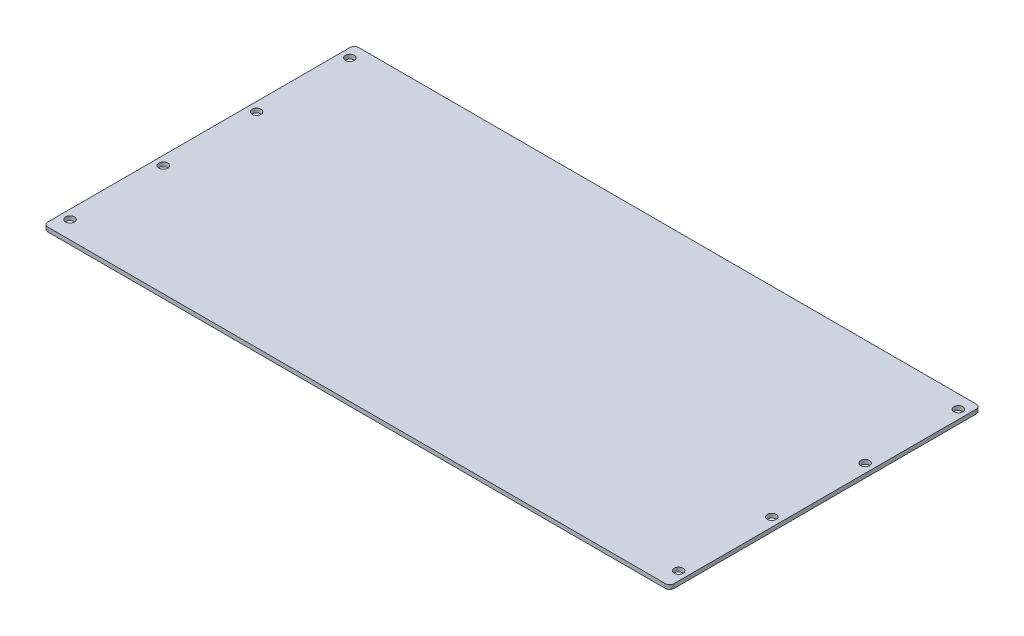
ISO-10303-21;
HEADER;
FILE_DESCRIPTION(('STEP AP214'),'2;1');
FILE_NAME('part.step','',(''),(''),'','','');
FILE_SCHEMA(('AUTOMOTIVE_DESIGN { 1 0 10303 214 1 1 1 1 }'));
ENDSEC;
DATA;
#1=APPLICATION_CONTEXT('core data for automotive mechanical design processes');
#2=APPLICATION_PROTOCOL_DEFINITION('international standard','automotive_design',2000,#1);
#3=PRODUCT_CONTEXT('',#1,'mechanical');
#4=PRODUCT('Part','Part','',(#3));
#5=PRODUCT_RELATED_PRODUCT_CATEGORY('part','',(#4));
#6=PRODUCT_DEFINITION_FORMATION('','',#4);
#7=PRODUCT_DEFINITION_CONTEXT('part definition',#1,'design');
#8=PRODUCT_DEFINITION('design','',#6,#7);
#9=PRODUCT_DEFINITION_SHAPE('','',#8);
#10=(LENGTH_UNIT() NAMED_UNIT(*) SI_UNIT(.MILLI.,.METRE.));
#11=(NAMED_UNIT(*) PLANE_ANGLE_UNIT() SI_UNIT($,.RADIAN.));
#12=(NAMED_UNIT(*) SI_UNIT($,.STERADIAN.) SOLID_ANGLE_UNIT());
#13=UNCERTAINTY_MEASURE_WITH_UNIT(LENGTH_MEASURE(1.E-05),#10,'distance_accuracy_value','');
#14=(GEOMETRIC_REPRESENTATION_CONTEXT(3) GLOBAL_UNCERTAINTY_ASSIGNED_CONTEXT((#13)) GLOBAL_UNIT_ASSIGNED_CONTEXT((#10,
#11,#12)) REPRESENTATION_CONTEXT('',''));
#15=CARTESIAN_POINT('',(0.,0.,0.));
#16=DIRECTION('',(0.,0.,1.));
#17=DIRECTION('',(1.,0.,0.));
#18=AXIS2_PLACEMENT_3D('',#15,#16,#17);
#19=CARTESIAN_POINT('',(220.6625,313.188238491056,272.550730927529));
#20=DIRECTION('',(0.,-1.,0.));
#21=DIRECTION('',(0.,0.,-1.));
#22=AXIS2_PLACEMENT_3D('',#19,#20,#21);
#23=CYLINDRICAL_SURFACE('',#22,3.175);
#24=CARTESIAN_POINT('',(220.6625,313.188238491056,272.550730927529));
#25=DIRECTION('',(0.,1.,0.));
#26=DIRECTION('',(0.,0.,1.));
#27=AXIS2_PLACEMENT_3D('',#24,#25,#26);
#28=CIRCLE('',#27,3.175);
#29=CARTESIAN_POINT('',(223.8375,313.188238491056,272.550730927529));
#30=VERTEX_POINT('',#29);
#31=CARTESIAN_POINT('',(220.6625,313.188238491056,269.375730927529));
#32=VERTEX_POINT('',#31);
#33=EDGE_CURVE('E178',#30,#32,#28,.T.);
#34=ORIENTED_EDGE('',*,*,#33,.F.);
#35=DIRECTION('',(0.,1.,0.));
#36=VECTOR('',#35,1.);
#37=CARTESIAN_POINT('',(223.8375,313.188238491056,272.550730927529));
#38=LINE('',#37,#36);
#39=CARTESIAN_POINT('',(223.8375,310.191038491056,272.550730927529));
#40=VERTEX_POINT('',#39);
#41=EDGE_CURVE('E213',#40,#30,#38,.T.);
#42=ORIENTED_EDGE('',*,*,#41,.F.);
#43=CARTESIAN_POINT('',(220.6625,310.191038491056,272.550730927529));
#44=DIRECTION('',(0.,-1.,0.));
#45=DIRECTION('',(0.,0.,1.));
#46=AXIS2_PLACEMENT_3D('',#43,#44,#45);
#47=CIRCLE('',#46,3.175);
#48=CARTESIAN_POINT('',(220.6625,310.191038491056,269.375730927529));
#49=VERTEX_POINT('',#48);
#50=EDGE_CURVE('E11',#49,#40,#47,.T.);
#51=ORIENTED_EDGE('',*,*,#50,.F.);
#52=DIRECTION('',(0.,-1.,0.));
#53=VECTOR('',#52,1.);
#54=CARTESIAN_POINT('',(220.6625,313.188238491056,269.375730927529));
#55=LINE('',#54,#53);
#56=EDGE_CURVE('E204',#32,#49,#55,.T.);
#57=ORIENTED_EDGE('',*,*,#56,.F.);
#58=EDGE_LOOP('',(#34,#42,#51,#57));
#59=FACE_BOUND('',#58,.T.);
#60=ADVANCED_FACE('F17',(#59),#23,.T.);
#61=CARTESIAN_POINT('',(-220.6625,313.188238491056,272.550730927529));
#62=DIRECTION('',(0.,1.,0.));
#63=DIRECTION('',(0.,0.,1.));
#64=AXIS2_PLACEMENT_3D('',#61,#62,#63);
#65=CYLINDRICAL_SURFACE('',#64,3.175);
#66=CARTESIAN_POINT('',(-220.6625,313.188238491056,272.550730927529));
#67=DIRECTION('',(0.,1.,0.));
#68=DIRECTION('',(0.,0.,1.));
#69=AXIS2_PLACEMENT_3D('',#66,#67,#68);
#70=CIRCLE('',#69,3.175);
#71=CARTESIAN_POINT('',(-220.6625,313.188238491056,269.375730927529));
#72=VERTEX_POINT('',#71);
#73=CARTESIAN_POINT('',(-223.8375,313.188238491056,272.550730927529));
#74=VERTEX_POINT('',#73);
#75=EDGE_CURVE('E282',#72,#74,#70,.T.);
#76=ORIENTED_EDGE('',*,*,#75,.F.);
#77=DIRECTION('',(0.,1.,0.));
#78=VECTOR('',#77,1.);
#79=CARTESIAN_POINT('',(-220.6625,313.188238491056,269.375730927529));
#80=LINE('',#79,#78);
#81=CARTESIAN_POINT('',(-220.6625,310.191038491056,269.375730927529));
#82=VERTEX_POINT('',#81);
#83=EDGE_CURVE('E234',#82,#72,#80,.T.);
#84=ORIENTED_EDGE('',*,*,#83,.F.);
#85=CARTESIAN_POINT('',(-220.6625,310.191038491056,272.550730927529));
#86=DIRECTION('',(0.,-1.,0.));
#87=DIRECTION('',(0.,0.,1.));
#88=AXIS2_PLACEMENT_3D('',#85,#86,#87);
#89=CIRCLE('',#88,3.175);
#90=CARTESIAN_POINT('',(-223.8375,310.191038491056,272.550730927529));
#91=VERTEX_POINT('',#90);
#92=EDGE_CURVE('E26',#91,#82,#89,.T.);
#93=ORIENTED_EDGE('',*,*,#92,.F.);
#94=DIRECTION('',(0.,-1.,0.));
#95=VECTOR('',#94,1.);
#96=CARTESIAN_POINT('',(-223.8375,310.191038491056,272.550730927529));
#97=LINE('',#96,#95);
#98=EDGE_CURVE('E221',#74,#91,#97,.T.);
#99=ORIENTED_EDGE('',*,*,#98,.F.);
#100=EDGE_LOOP('',(#76,#84,#93,#99));
#101=FACE_BOUND('',#100,.T.);
#102=ADVANCED_FACE('F321',(#101),#65,.T.);
#103=CARTESIAN_POINT('',(-220.6625,313.188238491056,488.450730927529));
#104=DIRECTION('',(0.,-1.,0.));
#105=DIRECTION('',(0.,0.,-1.));
#106=AXIS2_PLACEMENT_3D('',#103,#104,#105);
#107=CYLINDRICAL_SURFACE('',#106,3.175);
#108=CARTESIAN_POINT('',(-220.6625,313.188238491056,488.450730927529));
#109=DIRECTION('',(0.,1.,0.));
#110=DIRECTION('',(0.,0.,1.));
#111=AXIS2_PLACEMENT_3D('',#108,#109,#110);
#112=CIRCLE('',#111,3.175);
#113=CARTESIAN_POINT('',(-223.8375,313.188238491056,488.450730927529));
#114=VERTEX_POINT('',#113);
#115=CARTESIAN_POINT('',(-220.6625,313.188238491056,491.625730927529));
#116=VERTEX_POINT('',#115);
#117=EDGE_CURVE('E186',#114,#116,#112,.T.);
#118=ORIENTED_EDGE('',*,*,#117,.F.);
#119=DIRECTION('',(0.,1.,0.));
#120=VECTOR('',#119,1.);
#121=CARTESIAN_POINT('',(-223.8375,313.188238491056,488.450730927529));
#122=LINE('',#121,#120);
#123=CARTESIAN_POINT('',(-223.8375,310.191038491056,488.450730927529));
#124=VERTEX_POINT('',#123);
#125=EDGE_CURVE('E222',#124,#114,#122,.T.);
#126=ORIENTED_EDGE('',*,*,#125,.F.);
#127=CARTESIAN_POINT('',(-220.6625,310.191038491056,488.450730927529));
#128=DIRECTION('',(0.,-1.,0.));
#129=DIRECTION('',(0.,0.,1.));
#130=AXIS2_PLACEMENT_3D('',#127,#128,#129);
#131=CIRCLE('',#130,3.175);
#132=CARTESIAN_POINT('',(-220.6625,310.191038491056,491.625730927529));
#133=VERTEX_POINT('',#132);
#134=EDGE_CURVE('E20',#133,#124,#131,.T.);
#135=ORIENTED_EDGE('',*,*,#134,.F.);
#136=DIRECTION('',(0.,-1.,0.));
#137=VECTOR('',#136,1.);
#138=CARTESIAN_POINT('',(-220.6625,313.188238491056,491.625730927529));
#139=LINE('',#138,#137);
#140=EDGE_CURVE('E191',#116,#133,#139,.T.);
#141=ORIENTED_EDGE('',*,*,#140,.F.);
#142=EDGE_LOOP('',(#118,#126,#135,#141));
#143=FACE_BOUND('',#142,.T.);
#144=ADVANCED_FACE('F315',(#143),#107,.T.);
#145=CARTESIAN_POINT('',(220.6625,313.188238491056,488.450730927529));
#146=DIRECTION('',(0.,1.,0.));
#147=DIRECTION('',(0.,0.,1.));
#148=AXIS2_PLACEMENT_3D('',#145,#146,#147);
#149=CYLINDRICAL_SURFACE('',#148,3.175);
#150=CARTESIAN_POINT('',(220.6625,313.188238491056,488.450730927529));
#151=DIRECTION('',(0.,1.,0.));
#152=DIRECTION('',(0.,0.,1.));
#153=AXIS2_PLACEMENT_3D('',#150,#151,#152);
#154=CIRCLE('',#153,3.175);
#155=CARTESIAN_POINT('',(220.6625,313.188238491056,491.625730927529));
#156=VERTEX_POINT('',#155);
#157=CARTESIAN_POINT('',(223.8375,313.188238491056,488.450730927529));
#158=VERTEX_POINT('',#157);
#159=EDGE_CURVE('E166',#156,#158,#154,.T.);
#160=ORIENTED_EDGE('',*,*,#159,.F.);
#161=DIRECTION('',(0.,1.,0.));
#162=VECTOR('',#161,1.);
#163=CARTESIAN_POINT('',(220.6625,313.188238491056,491.625730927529));
#164=LINE('',#163,#162);
#165=CARTESIAN_POINT('',(220.6625,310.191038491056,491.625730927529));
#166=VERTEX_POINT('',#165);
#167=EDGE_CURVE('E170',#166,#156,#164,.T.);
#168=ORIENTED_EDGE('',*,*,#167,.F.);
#169=CARTESIAN_POINT('',(220.6625,310.191038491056,488.450730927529));
#170=DIRECTION('',(0.,-1.,0.));
#171=DIRECTION('',(0.,0.,1.));
#172=AXIS2_PLACEMENT_3D('',#169,#170,#171);
#173=CIRCLE('',#172,3.175);
#174=CARTESIAN_POINT('',(223.8375,310.191038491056,488.450730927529));
#175=VERTEX_POINT('',#174);
#176=EDGE_CURVE('E277',#175,#166,#173,.T.);
#177=ORIENTED_EDGE('',*,*,#176,.F.);
#178=DIRECTION('',(0.,-1.,0.));
#179=VECTOR('',#178,1.);
#180=CARTESIAN_POINT('',(223.8375,310.191038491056,488.450730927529));
#181=LINE('',#180,#179);
#182=EDGE_CURVE('E173',#158,#175,#181,.T.);
#183=ORIENTED_EDGE('',*,*,#182,.F.);
#184=EDGE_LOOP('',(#160,#168,#177,#183));
#185=FACE_BOUND('',#184,.T.);
#186=ADVANCED_FACE('F168',(#185),#149,.T.);
#187=CARTESIAN_POINT('',(217.4875,313.188238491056,412.250730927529));
#188=DIRECTION('',(0.,-1.,0.));
#189=DIRECTION('',(0.,0.,-1.));
#190=AXIS2_PLACEMENT_3D('',#187,#188,#189);
#191=CYLINDRICAL_SURFACE('',#190,3.175);
#192=CARTESIAN_POINT('',(217.4875,310.191038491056,412.250730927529));
#193=DIRECTION('',(0.,-1.,0.));
#194=DIRECTION('',(0.,0.,1.));
#195=AXIS2_PLACEMENT_3D('',#192,#193,#194);
#196=CIRCLE('',#195,3.175);
#197=CARTESIAN_POINT('',(217.4875,310.191038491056,415.425730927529));
#198=VERTEX_POINT('',#197);
#199=EDGE_CURVE('E291',#198,#198,#196,.T.);
#200=ORIENTED_EDGE('',*,*,#199,.T.);
#201=EDGE_LOOP('',(#200));
#202=FACE_BOUND('',#201,.T.);
#203=CARTESIAN_POINT('',(217.4875,313.188238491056,412.250730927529));
#204=DIRECTION('',(0.,-1.,0.));
#205=DIRECTION('',(0.,0.,-1.));
#206=AXIS2_PLACEMENT_3D('',#203,#204,#205);
#207=CIRCLE('',#206,3.175);
#208=CARTESIAN_POINT('',(217.4875,313.188238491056,409.075730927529));
#209=VERTEX_POINT('',#208);
#210=EDGE_CURVE('E249',#209,#209,#207,.T.);
#211=ORIENTED_EDGE('',*,*,#210,.F.);
#212=EDGE_LOOP('',(#211));
#213=FACE_BOUND('',#212,.T.);
#214=ADVANCED_FACE('F357',(#202,#213),#191,.F.);
#215=CARTESIAN_POINT('',(217.4875,313.188238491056,345.575730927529));
#216=DIRECTION('',(0.,-1.,0.));
#217=DIRECTION('',(0.,0.,-1.));
#218=AXIS2_PLACEMENT_3D('',#215,#216,#217);
#219=CYLINDRICAL_SURFACE('',#218,3.175);
#220=CARTESIAN_POINT('',(217.4875,310.191038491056,345.575730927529));
#221=DIRECTION('',(0.,-1.,0.));
#222=DIRECTION('',(0.,0.,1.));
#223=AXIS2_PLACEMENT_3D('',#220,#221,#222);
#224=CIRCLE('',#223,3.175);
#225=CARTESIAN_POINT('',(217.4875,310.191038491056,348.750730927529));
#226=VERTEX_POINT('',#225);
#227=EDGE_CURVE('E286',#226,#226,#224,.T.);
#228=ORIENTED_EDGE('',*,*,#227,.T.);
#229=EDGE_LOOP('',(#228));
#230=FACE_BOUND('',#229,.T.);
#231=CARTESIAN_POINT('',(217.4875,313.188238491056,345.575730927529));
#232=DIRECTION('',(0.,-1.,0.));
#233=DIRECTION('',(0.,0.,-1.));
#234=AXIS2_PLACEMENT_3D('',#231,#232,#233);
#235=CIRCLE('',#234,3.175);
#236=CARTESIAN_POINT('',(217.4875,313.188238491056,342.400730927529));
#237=VERTEX_POINT('',#236);
#238=EDGE_CURVE('E252',#237,#237,#235,.T.);
#239=ORIENTED_EDGE('',*,*,#238,.F.);
#240=EDGE_LOOP('',(#239));
#241=FACE_BOUND('',#240,.T.);
#242=ADVANCED_FACE('F353',(#230,#241),#219,.F.);
#243=CARTESIAN_POINT('',(217.4875,313.188238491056,278.900730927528));
#244=DIRECTION('',(0.,-1.,0.));
#245=DIRECTION('',(0.,0.,-1.));
#246=AXIS2_PLACEMENT_3D('',#243,#244,#245);
#247=CYLINDRICAL_SURFACE('',#246,3.175);
#248=CARTESIAN_POINT('',(217.4875,310.191038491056,278.900730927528));
#249=DIRECTION('',(0.,-1.,0.));
#250=DIRECTION('',(0.,0.,1.));
#251=AXIS2_PLACEMENT_3D('',#248,#249,#250);
#252=CIRCLE('',#251,3.175);
#253=CARTESIAN_POINT('',(217.4875,310.191038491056,282.075730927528));
#254=VERTEX_POINT('',#253);
#255=EDGE_CURVE('E283',#254,#254,#252,.T.);
#256=ORIENTED_EDGE('',*,*,#255,.T.);
#257=EDGE_LOOP('',(#256));
#258=FACE_BOUND('',#257,.T.);
#259=CARTESIAN_POINT('',(217.4875,313.188238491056,278.900730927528));
#260=DIRECTION('',(0.,-1.,0.));
#261=DIRECTION('',(0.,0.,-1.));
#262=AXIS2_PLACEMENT_3D('',#259,#260,#261);
#263=CIRCLE('',#262,3.175);
#264=CARTESIAN_POINT('',(217.4875,313.188238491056,275.725730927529));
#265=VERTEX_POINT('',#264);
#266=EDGE_CURVE('E255',#265,#265,#263,.T.);
#267=ORIENTED_EDGE('',*,*,#266,.F.);
#268=EDGE_LOOP('',(#267));
#269=FACE_BOUND('',#268,.T.);
#270=ADVANCED_FACE('F356',(#258,#269),#247,.F.);
#271=CARTESIAN_POINT('',(-217.4875,313.188238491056,278.900730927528));
#272=DIRECTION('',(0.,-1.,0.));
#273=DIRECTION('',(0.,0.,-1.));
#274=AXIS2_PLACEMENT_3D('',#271,#272,#273);
#275=CYLINDRICAL_SURFACE('',#274,3.175);
#276=CARTESIAN_POINT('',(-217.4875,310.191038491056,278.900730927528));
#277=DIRECTION('',(0.,-1.,0.));
#278=DIRECTION('',(0.,0.,1.));
#279=AXIS2_PLACEMENT_3D('',#276,#277,#278);
#280=CIRCLE('',#279,3.175);
#281=CARTESIAN_POINT('',(-217.4875,310.191038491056,282.075730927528));
#282=VERTEX_POINT('',#281);
#283=EDGE_CURVE('E272',#282,#282,#280,.T.);
#284=ORIENTED_EDGE('',*,*,#283,.T.);
#285=EDGE_LOOP('',(#284));
#286=FACE_BOUND('',#285,.T.);
#287=CARTESIAN_POINT('',(-217.4875,313.188238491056,278.900730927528));
#288=DIRECTION('',(0.,-1.,0.));
#289=DIRECTION('',(0.,0.,-1.));
#290=AXIS2_PLACEMENT_3D('',#287,#288,#289);
#291=CIRCLE('',#290,3.175);
#292=CARTESIAN_POINT('',(-217.4875,313.188238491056,275.725730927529));
#293=VERTEX_POINT('',#292);
#294=EDGE_CURVE('E258',#293,#293,#291,.T.);
#295=ORIENTED_EDGE('',*,*,#294,.F.);
#296=EDGE_LOOP('',(#295));
#297=FACE_BOUND('',#296,.T.);
#298=ADVANCED_FACE('F359',(#286,#297),#275,.F.);
#299=CARTESIAN_POINT('',(-217.4875,313.188238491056,345.575730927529));
#300=DIRECTION('',(0.,-1.,0.));
#301=DIRECTION('',(0.,0.,-1.));
#302=AXIS2_PLACEMENT_3D('',#299,#300,#301);
#303=CYLINDRICAL_SURFACE('',#302,3.175);
#304=CARTESIAN_POINT('',(-217.4875,310.191038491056,345.575730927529));
#305=DIRECTION('',(0.,-1.,0.));
#306=DIRECTION('',(0.,0.,1.));
#307=AXIS2_PLACEMENT_3D('',#304,#305,#306);
#308=CIRCLE('',#307,3.175);
#309=CARTESIAN_POINT('',(-217.4875,310.191038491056,348.750730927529));
#310=VERTEX_POINT('',#309);
#311=EDGE_CURVE('E268',#310,#310,#308,.T.);
#312=ORIENTED_EDGE('',*,*,#311,.T.);
#313=EDGE_LOOP('',(#312));
#314=FACE_BOUND('',#313,.T.);
#315=CARTESIAN_POINT('',(-217.4875,313.188238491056,345.575730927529));
#316=DIRECTION('',(0.,-1.,0.));
#317=DIRECTION('',(0.,0.,-1.));
#318=AXIS2_PLACEMENT_3D('',#315,#316,#317);
#319=CIRCLE('',#318,3.175);
#320=CARTESIAN_POINT('',(-217.4875,313.188238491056,342.400730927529));
#321=VERTEX_POINT('',#320);
#322=EDGE_CURVE('E259',#321,#321,#319,.T.);
#323=ORIENTED_EDGE('',*,*,#322,.F.);
#324=EDGE_LOOP('',(#323));
#325=FACE_BOUND('',#324,.T.);
#326=ADVANCED_FACE('F362',(#314,#325),#303,.F.);
#327=CARTESIAN_POINT('',(-217.4875,313.188238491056,412.250730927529));
#328=DIRECTION('',(0.,-1.,0.));
#329=DIRECTION('',(0.,0.,-1.));
#330=AXIS2_PLACEMENT_3D('',#327,#328,#329);
#331=CYLINDRICAL_SURFACE('',#330,3.175);
#332=CARTESIAN_POINT('',(-217.4875,310.191038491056,412.250730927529));
#333=DIRECTION('',(0.,-1.,0.));
#334=DIRECTION('',(0.,0.,1.));
#335=AXIS2_PLACEMENT_3D('',#332,#333,#334);
#336=CIRCLE('',#335,3.175);
#337=CARTESIAN_POINT('',(-217.4875,310.191038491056,415.425730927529));
#338=VERTEX_POINT('',#337);
#339=EDGE_CURVE('E271',#338,#338,#336,.T.);
#340=ORIENTED_EDGE('',*,*,#339,.T.);
#341=EDGE_LOOP('',(#340));
#342=FACE_BOUND('',#341,.T.);
#343=CARTESIAN_POINT('',(-217.4875,313.188238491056,412.250730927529));
#344=DIRECTION('',(0.,-1.,0.));
#345=DIRECTION('',(0.,0.,-1.));
#346=AXIS2_PLACEMENT_3D('',#343,#344,#345);
#347=CIRCLE('',#346,3.175);
#348=CARTESIAN_POINT('',(-217.4875,313.188238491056,409.075730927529));
#349=VERTEX_POINT('',#348);
#350=EDGE_CURVE('E262',#349,#349,#347,.T.);
#351=ORIENTED_EDGE('',*,*,#350,.F.);
#352=EDGE_LOOP('',(#351));
#353=FACE_BOUND('',#352,.T.);
#354=ADVANCED_FACE('F369',(#342,#353),#331,.F.);
#355=CARTESIAN_POINT('',(-217.4875,313.188238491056,478.925730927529));
#356=DIRECTION('',(0.,-1.,0.));
#357=DIRECTION('',(0.,0.,-1.));
#358=AXIS2_PLACEMENT_3D('',#355,#356,#357);
#359=CYLINDRICAL_SURFACE('',#358,3.175);
#360=CARTESIAN_POINT('',(-217.4875,310.191038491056,478.925730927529));
#361=DIRECTION('',(0.,-1.,0.));
#362=DIRECTION('',(0.,0.,1.));
#363=AXIS2_PLACEMENT_3D('',#360,#361,#362);
#364=CIRCLE('',#363,3.175);
#365=CARTESIAN_POINT('',(-217.4875,310.191038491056,482.100730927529));
#366=VERTEX_POINT('',#365);
#367=EDGE_CURVE('E43',#366,#366,#364,.T.);
#368=ORIENTED_EDGE('',*,*,#367,.T.);
#369=EDGE_LOOP('',(#368));
#370=FACE_BOUND('',#369,.T.);
#371=CARTESIAN_POINT('',(-217.4875,313.188238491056,478.925730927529));
#372=DIRECTION('',(0.,-1.,0.));
#373=DIRECTION('',(0.,0.,-1.));
#374=AXIS2_PLACEMENT_3D('',#371,#372,#373);
#375=CIRCLE('',#374,3.175);
#376=CARTESIAN_POINT('',(-217.4875,313.188238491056,475.750730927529));
#377=VERTEX_POINT('',#376);
#378=EDGE_CURVE('E267',#377,#377,#375,.T.);
#379=ORIENTED_EDGE('',*,*,#378,.F.);
#380=EDGE_LOOP('',(#379));
#381=FACE_BOUND('',#380,.T.);
#382=ADVANCED_FACE('F371',(#370,#381),#359,.F.);
#383=CARTESIAN_POINT('',(217.4875,313.188238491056,478.925730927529));
#384=DIRECTION('',(0.,-1.,0.));
#385=DIRECTION('',(0.,0.,-1.));
#386=AXIS2_PLACEMENT_3D('',#383,#384,#385);
#387=CYLINDRICAL_SURFACE('',#386,3.175);
#388=CARTESIAN_POINT('',(217.4875,310.191038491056,478.925730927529));
#389=DIRECTION('',(0.,-1.,0.));
#390=DIRECTION('',(0.,0.,1.));
#391=AXIS2_PLACEMENT_3D('',#388,#389,#390);
#392=CIRCLE('',#391,3.175);
#393=CARTESIAN_POINT('',(217.4875,310.191038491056,482.100730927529));
#394=VERTEX_POINT('',#393);
#395=EDGE_CURVE('E36',#394,#394,#392,.T.);
#396=ORIENTED_EDGE('',*,*,#395,.T.);
#397=EDGE_LOOP('',(#396));
#398=FACE_BOUND('',#397,.T.);
#399=CARTESIAN_POINT('',(217.4875,313.188238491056,478.925730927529));
#400=DIRECTION('',(0.,-1.,0.));
#401=DIRECTION('',(0.,0.,-1.));
#402=AXIS2_PLACEMENT_3D('',#399,#400,#401);
#403=CIRCLE('',#402,3.175);
#404=CARTESIAN_POINT('',(217.4875,313.188238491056,475.750730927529));
#405=VERTEX_POINT('',#404);
#406=EDGE_CURVE('E179',#405,#405,#403,.T.);
#407=ORIENTED_EDGE('',*,*,#406,.F.);
#408=EDGE_LOOP('',(#407));
#409=FACE_BOUND('',#408,.T.);
#410=ADVANCED_FACE('F374',(#398,#409),#387,.F.);
#411=CARTESIAN_POINT('',(-1.4986,310.191038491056,380.500730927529));
#412=DIRECTION('',(0.,1.,0.));
#413=DIRECTION('',(1.,0.,0.));
#414=AXIS2_PLACEMENT_3D('',#411,#412,#413);
#415=PLANE('',#414);
#416=DIRECTION('',(0.,0.,-1.));
#417=VECTOR('',#416,1.);
#418=CARTESIAN_POINT('',(223.8375,310.191038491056,380.500730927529));
#419=LINE('',#418,#417);
#420=EDGE_CURVE('E209',#175,#40,#419,.T.);
#421=ORIENTED_EDGE('',*,*,#420,.F.);
#422=ORIENTED_EDGE('',*,*,#176,.T.);
#423=DIRECTION('',(-1.,0.,0.));
#424=VECTOR('',#423,1.);
#425=CARTESIAN_POINT('',(0.,310.191038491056,491.625730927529));
#426=LINE('',#425,#424);
#427=EDGE_CURVE('E195',#166,#133,#426,.T.);
#428=ORIENTED_EDGE('',*,*,#427,.T.);
#429=ORIENTED_EDGE('',*,*,#134,.T.);
#430=DIRECTION('',(0.,0.,-1.));
#431=VECTOR('',#430,1.);
#432=CARTESIAN_POINT('',(-223.8375,310.191038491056,380.500730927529));
#433=LINE('',#432,#431);
#434=EDGE_CURVE('E207',#124,#91,#433,.T.);
#435=ORIENTED_EDGE('',*,*,#434,.T.);
#436=ORIENTED_EDGE('',*,*,#92,.T.);
#437=DIRECTION('',(-1.,0.,0.));
#438=VECTOR('',#437,1.);
#439=CARTESIAN_POINT('',(0.,310.191038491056,269.375730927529));
#440=LINE('',#439,#438);
#441=EDGE_CURVE('E230',#49,#82,#440,.T.);
#442=ORIENTED_EDGE('',*,*,#441,.F.);
#443=ORIENTED_EDGE('',*,*,#50,.T.);
#444=EDGE_LOOP('',(#421,#422,#428,#429,#435,#436,#442,#443));
#445=FACE_BOUND('',#444,.T.);
#446=ORIENTED_EDGE('',*,*,#395,.F.);
#447=EDGE_LOOP('',(#446));
#448=FACE_BOUND('',#447,.T.);
#449=ORIENTED_EDGE('',*,*,#367,.F.);
#450=EDGE_LOOP('',(#449));
#451=FACE_BOUND('',#450,.T.);
#452=ORIENTED_EDGE('',*,*,#339,.F.);
#453=EDGE_LOOP('',(#452));
#454=FACE_BOUND('',#453,.T.);
#455=ORIENTED_EDGE('',*,*,#311,.F.);
#456=EDGE_LOOP('',(#455));
#457=FACE_BOUND('',#456,.T.);
#458=ORIENTED_EDGE('',*,*,#283,.F.);
#459=EDGE_LOOP('',(#458));
#460=FACE_BOUND('',#459,.T.);
#461=ORIENTED_EDGE('',*,*,#255,.F.);
#462=EDGE_LOOP('',(#461));
#463=FACE_BOUND('',#462,.T.);
#464=ORIENTED_EDGE('',*,*,#227,.F.);
#465=EDGE_LOOP('',(#464));
#466=FACE_BOUND('',#465,.T.);
#467=ORIENTED_EDGE('',*,*,#199,.F.);
#468=EDGE_LOOP('',(#467));
#469=FACE_BOUND('',#468,.T.);
#470=ADVANCED_FACE('F310',(#445,#448,#451,#454,#457,#460,#463,#466,#469),#415,.F.);
#471=CARTESIAN_POINT('',(-1.4986,313.188238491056,380.500730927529));
#472=DIRECTION('',(0.,1.,0.));
#473=DIRECTION('',(1.,0.,0.));
#474=AXIS2_PLACEMENT_3D('',#471,#472,#473);
#475=PLANE('',#474);
#476=DIRECTION('',(-1.,0.,0.));
#477=VECTOR('',#476,1.);
#478=CARTESIAN_POINT('',(0.,313.188238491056,491.625730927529));
#479=LINE('',#478,#477);
#480=EDGE_CURVE('E182',#156,#116,#479,.T.);
#481=ORIENTED_EDGE('',*,*,#480,.F.);
#482=ORIENTED_EDGE('',*,*,#159,.T.);
#483=DIRECTION('',(0.,0.,-1.));
#484=VECTOR('',#483,1.);
#485=CARTESIAN_POINT('',(223.8375,313.188238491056,380.500730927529));
#486=LINE('',#485,#484);
#487=EDGE_CURVE('E215',#158,#30,#486,.T.);
#488=ORIENTED_EDGE('',*,*,#487,.T.);
#489=ORIENTED_EDGE('',*,*,#33,.T.);
#490=DIRECTION('',(-1.,0.,0.));
#491=VECTOR('',#490,1.);
#492=CARTESIAN_POINT('',(0.,313.188238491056,269.375730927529));
#493=LINE('',#492,#491);
#494=EDGE_CURVE('E208',#32,#72,#493,.T.);
#495=ORIENTED_EDGE('',*,*,#494,.T.);
#496=ORIENTED_EDGE('',*,*,#75,.T.);
#497=DIRECTION('',(0.,0.,-1.));
#498=VECTOR('',#497,1.);
#499=CARTESIAN_POINT('',(-223.8375,313.188238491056,380.500730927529));
#500=LINE('',#499,#498);
#501=EDGE_CURVE('E217',#114,#74,#500,.T.);
#502=ORIENTED_EDGE('',*,*,#501,.F.);
#503=ORIENTED_EDGE('',*,*,#117,.T.);
#504=EDGE_LOOP('',(#481,#482,#488,#489,#495,#496,#502,#503));
#505=FACE_BOUND('',#504,.T.);
#506=ORIENTED_EDGE('',*,*,#406,.T.);
#507=EDGE_LOOP('',(#506));
#508=FACE_BOUND('',#507,.T.);
#509=ORIENTED_EDGE('',*,*,#378,.T.);
#510=EDGE_LOOP('',(#509));
#511=FACE_BOUND('',#510,.T.);
#512=ORIENTED_EDGE('',*,*,#350,.T.);
#513=EDGE_LOOP('',(#512));
#514=FACE_BOUND('',#513,.T.);
#515=ORIENTED_EDGE('',*,*,#322,.T.);
#516=EDGE_LOOP('',(#515));
#517=FACE_BOUND('',#516,.T.);
#518=ORIENTED_EDGE('',*,*,#294,.T.);
#519=EDGE_LOOP('',(#518));
#520=FACE_BOUND('',#519,.T.);
#521=ORIENTED_EDGE('',*,*,#266,.T.);
#522=EDGE_LOOP('',(#521));
#523=FACE_BOUND('',#522,.T.);
#524=ORIENTED_EDGE('',*,*,#238,.T.);
#525=EDGE_LOOP('',(#524));
#526=FACE_BOUND('',#525,.T.);
#527=ORIENTED_EDGE('',*,*,#210,.T.);
#528=EDGE_LOOP('',(#527));
#529=FACE_BOUND('',#528,.T.);
#530=ADVANCED_FACE('F183',(#505,#508,#511,#514,#517,#520,#523,#526,#529),#475,.T.);
#531=CARTESIAN_POINT('',(-223.8375,313.188238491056,380.500730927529));
#532=DIRECTION('',(-1.,0.,0.));
#533=DIRECTION('',(0.,0.,1.));
#534=AXIS2_PLACEMENT_3D('',#531,#532,#533);
#535=PLANE('',#534);
#536=ORIENTED_EDGE('',*,*,#434,.F.);
#537=ORIENTED_EDGE('',*,*,#125,.T.);
#538=ORIENTED_EDGE('',*,*,#501,.T.);
#539=ORIENTED_EDGE('',*,*,#98,.T.);
#540=EDGE_LOOP('',(#536,#537,#538,#539));
#541=FACE_BOUND('',#540,.T.);
#542=ADVANCED_FACE('F318',(#541),#535,.T.);
#543=CARTESIAN_POINT('',(0.,313.188238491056,269.375730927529));
#544=DIRECTION('',(0.,0.,1.));
#545=DIRECTION('',(1.,0.,0.));
#546=AXIS2_PLACEMENT_3D('',#543,#544,#545);
#547=PLANE('',#546);
#548=ORIENTED_EDGE('',*,*,#441,.T.);
#549=ORIENTED_EDGE('',*,*,#83,.T.);
#550=ORIENTED_EDGE('',*,*,#494,.F.);
#551=ORIENTED_EDGE('',*,*,#56,.T.);
#552=EDGE_LOOP('',(#548,#549,#550,#551));
#553=FACE_BOUND('',#552,.T.);
#554=ADVANCED_FACE('F326',(#553),#547,.F.);
#555=CARTESIAN_POINT('',(223.8375,313.188238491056,380.500730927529));
#556=DIRECTION('',(-1.,0.,0.));
#557=DIRECTION('',(0.,0.,1.));
#558=AXIS2_PLACEMENT_3D('',#555,#556,#557);
#559=PLANE('',#558);
#560=ORIENTED_EDGE('',*,*,#487,.F.);
#561=ORIENTED_EDGE('',*,*,#182,.T.);
#562=ORIENTED_EDGE('',*,*,#420,.T.);
#563=ORIENTED_EDGE('',*,*,#41,.T.);
#564=EDGE_LOOP('',(#560,#561,#562,#563));
#565=FACE_BOUND('',#564,.T.);
#566=ADVANCED_FACE('F331',(#565),#559,.F.);
#567=CARTESIAN_POINT('',(0.,313.188238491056,491.625730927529));
#568=DIRECTION('',(0.,0.,1.));
#569=DIRECTION('',(1.,0.,0.));
#570=AXIS2_PLACEMENT_3D('',#567,#568,#569);
#571=PLANE('',#570);
#572=ORIENTED_EDGE('',*,*,#427,.F.);
#573=ORIENTED_EDGE('',*,*,#167,.T.);
#574=ORIENTED_EDGE('',*,*,#480,.T.);
#575=ORIENTED_EDGE('',*,*,#140,.T.);
#576=EDGE_LOOP('',(#572,#573,#574,#575));
#577=FACE_BOUND('',#576,.T.);
#578=ADVANCED_FACE('F193',(#577),#571,.T.);
#579=CLOSED_SHELL('',(#60,#102,#144,#186,#214,#242,#270,#298,#326,#354,#382,#410,#470,#530,#542,
#554,#566,#578));
#580=MANIFOLD_SOLID_BREP('B1',#579);
#581=ADVANCED_BREP_SHAPE_REPRESENTATION('',(#18,#580),#14);
#582=SHAPE_DEFINITION_REPRESENTATION(#9,#581);
ENDSEC;
END-ISO-10303-21;
